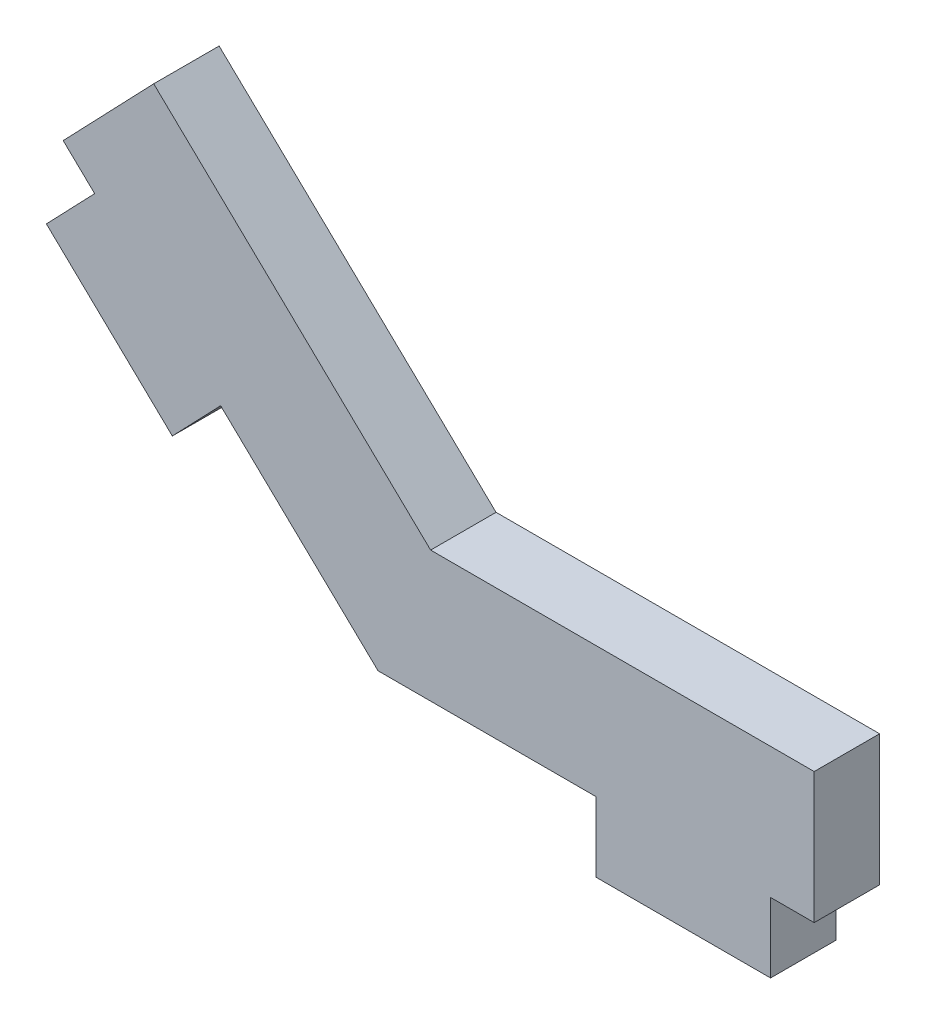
from build123d import *

# Parameters (mm, degrees)
EXTRUDE_1_DEPTH = 3
SKETCH_1_3_W    = 8
SKETCH_1_3_H    = 3.2
EXTRUDE_2_DEPTH = 3


with BuildPart() as part:
    # Sketch 1 → Extrude 1 (new body)
    with BuildSketch(Plane.XY):
        Polygon((20, 6), (20, 0), (0, 0), (-14.440035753, 13.837823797), (-10.288688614, 18.169834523), (2.410768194, 6), align=None)
    extrude(amount=EXTRUDE_1_DEPTH)

    # Sketch 1_3 → Extrude 2 (add)
    with BuildSketch(Plane.XY):
        Polygon((-9.434069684, 4.608506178), (-7.220017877, 6.918911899), (-12.996032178, 12.454041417), (-15.210083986, 10.143635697), align=None)
        with Locations((14, -1.6)):
            Rectangle(SKETCH_1_3_W, SKETCH_1_3_H)
    extrude(amount=EXTRUDE_2_DEPTH)


solid = part.part
